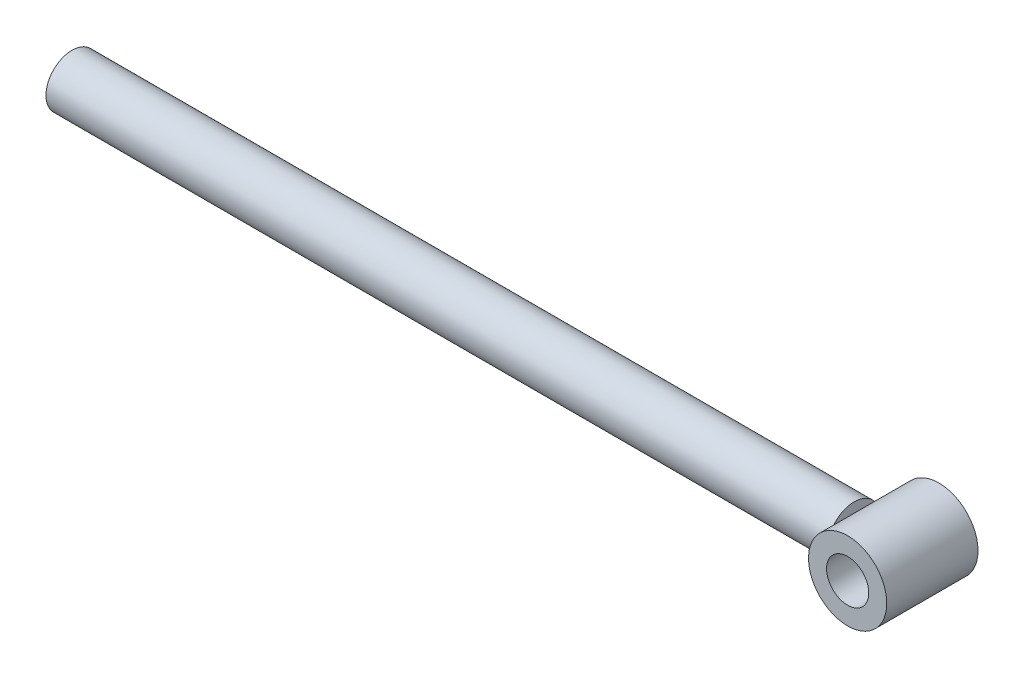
ISO-10303-21;
HEADER;
FILE_DESCRIPTION(('STEP AP214'),'2;1');
FILE_NAME('part.step','',(''),(''),'','','');
FILE_SCHEMA(('AUTOMOTIVE_DESIGN { 1 0 10303 214 1 1 1 1 }'));
ENDSEC;
DATA;
#1=APPLICATION_CONTEXT('core data for automotive mechanical design processes');
#2=APPLICATION_PROTOCOL_DEFINITION('international standard','automotive_design',2000,#1);
#3=PRODUCT_CONTEXT('',#1,'mechanical');
#4=PRODUCT('Part','Part','',(#3));
#5=PRODUCT_RELATED_PRODUCT_CATEGORY('part','',(#4));
#6=PRODUCT_DEFINITION_FORMATION('','',#4);
#7=PRODUCT_DEFINITION_CONTEXT('part definition',#1,'design');
#8=PRODUCT_DEFINITION('design','',#6,#7);
#9=PRODUCT_DEFINITION_SHAPE('','',#8);
#10=(LENGTH_UNIT() NAMED_UNIT(*) SI_UNIT(.MILLI.,.METRE.));
#11=(NAMED_UNIT(*) PLANE_ANGLE_UNIT() SI_UNIT($,.RADIAN.));
#12=(NAMED_UNIT(*) SI_UNIT($,.STERADIAN.) SOLID_ANGLE_UNIT());
#13=UNCERTAINTY_MEASURE_WITH_UNIT(LENGTH_MEASURE(1.E-05),#10,'distance_accuracy_value','');
#14=(GEOMETRIC_REPRESENTATION_CONTEXT(3) GLOBAL_UNCERTAINTY_ASSIGNED_CONTEXT((#13)) GLOBAL_UNIT_ASSIGNED_CONTEXT((#10,
#11,#12)) REPRESENTATION_CONTEXT('',''));
#15=CARTESIAN_POINT('',(0.,0.,0.));
#16=DIRECTION('',(0.,0.,1.));
#17=DIRECTION('',(1.,0.,0.));
#18=AXIS2_PLACEMENT_3D('',#15,#16,#17);
#19=CARTESIAN_POINT('',(315.,0.,17.5));
#20=DIRECTION('',(0.,0.,1.));
#21=DIRECTION('',(1.,0.,0.));
#22=AXIS2_PLACEMENT_3D('',#19,#20,#21);
#23=PLANE('',#22);
#24=CARTESIAN_POINT('',(315.,0.,17.5));
#25=DIRECTION('',(0.,0.,1.));
#26=DIRECTION('',(1.,0.,0.));
#27=AXIS2_PLACEMENT_3D('',#24,#25,#26);
#28=CIRCLE('',#27,15.);
#29=CARTESIAN_POINT('',(330.,0.,17.5));
#30=VERTEX_POINT('',#29);
#31=EDGE_CURVE('E11',#30,#30,#28,.T.);
#32=ORIENTED_EDGE('',*,*,#31,.T.);
#33=EDGE_LOOP('',(#32));
#34=FACE_BOUND('',#33,.T.);
#35=CARTESIAN_POINT('',(315.,0.,17.5));
#36=DIRECTION('',(0.,0.,1.));
#37=DIRECTION('',(1.,0.,0.));
#38=AXIS2_PLACEMENT_3D('',#35,#36,#37);
#39=CIRCLE('',#38,8.09999999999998);
#40=CARTESIAN_POINT('',(323.1,0.,17.5));
#41=VERTEX_POINT('',#40);
#42=EDGE_CURVE('E47',#41,#41,#39,.T.);
#43=ORIENTED_EDGE('',*,*,#42,.F.);
#44=EDGE_LOOP('',(#43));
#45=FACE_BOUND('',#44,.T.);
#46=ADVANCED_FACE('F36',(#34,#45),#23,.T.);
#47=CARTESIAN_POINT('',(315.,0.,-17.5));
#48=DIRECTION('',(0.,0.,1.));
#49=DIRECTION('',(1.,0.,0.));
#50=AXIS2_PLACEMENT_3D('',#47,#48,#49);
#51=PLANE('',#50);
#52=CARTESIAN_POINT('',(315.,0.,-17.5));
#53=DIRECTION('',(0.,0.,1.));
#54=DIRECTION('',(1.,0.,0.));
#55=AXIS2_PLACEMENT_3D('',#52,#53,#54);
#56=CIRCLE('',#55,15.);
#57=CARTESIAN_POINT('',(330.,0.,-17.5));
#58=VERTEX_POINT('',#57);
#59=EDGE_CURVE('E43',#58,#58,#56,.T.);
#60=ORIENTED_EDGE('',*,*,#59,.F.);
#61=EDGE_LOOP('',(#60));
#62=FACE_BOUND('',#61,.T.);
#63=CARTESIAN_POINT('',(315.,0.,-17.5));
#64=DIRECTION('',(0.,0.,1.));
#65=DIRECTION('',(1.,0.,0.));
#66=AXIS2_PLACEMENT_3D('',#63,#64,#65);
#67=CIRCLE('',#66,8.09999999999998);
#68=CARTESIAN_POINT('',(323.1,0.,-17.5));
#69=VERTEX_POINT('',#68);
#70=EDGE_CURVE('E51',#69,#69,#67,.T.);
#71=ORIENTED_EDGE('',*,*,#70,.T.);
#72=EDGE_LOOP('',(#71));
#73=FACE_BOUND('',#72,.T.);
#74=ADVANCED_FACE('F57',(#62,#73),#51,.F.);
#75=CARTESIAN_POINT('',(315.,0.,17.5));
#76=DIRECTION('',(0.,0.,-1.));
#77=DIRECTION('',(-1.,0.,0.));
#78=AXIS2_PLACEMENT_3D('',#75,#76,#77);
#79=CYLINDRICAL_SURFACE('',#78,15.);
#80=ORIENTED_EDGE('',*,*,#31,.F.);
#81=EDGE_LOOP('',(#80));
#82=FACE_BOUND('',#81,.T.);
#83=ORIENTED_EDGE('',*,*,#59,.T.);
#84=EDGE_LOOP('',(#83));
#85=FACE_BOUND('',#84,.T.);
#86=ADVANCED_FACE('F38',(#82,#85),#79,.T.);
#87=CARTESIAN_POINT('',(315.,0.,17.5));
#88=DIRECTION('',(0.,0.,-1.));
#89=DIRECTION('',(-1.,0.,0.));
#90=AXIS2_PLACEMENT_3D('',#87,#88,#89);
#91=CYLINDRICAL_SURFACE('',#90,8.09999999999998);
#92=ORIENTED_EDGE('',*,*,#42,.T.);
#93=EDGE_LOOP('',(#92));
#94=FACE_BOUND('',#93,.T.);
#95=ORIENTED_EDGE('',*,*,#70,.F.);
#96=EDGE_LOOP('',(#95));
#97=FACE_BOUND('',#96,.T.);
#98=ADVANCED_FACE('F59',(#94,#97),#91,.F.);
#99=CLOSED_SHELL('',(#46,#74,#86,#98));
#100=MANIFOLD_SOLID_BREP('B2',#99);
#101=CARTESIAN_POINT('',(300.,0.,0.));
#102=DIRECTION('',(-1.,0.,0.));
#103=DIRECTION('',(0.,0.,1.));
#104=AXIS2_PLACEMENT_3D('',#101,#102,#103);
#105=CYLINDRICAL_SURFACE('',#104,10.);
#106=CARTESIAN_POINT('',(300.,0.,0.));
#107=DIRECTION('',(1.,0.,0.));
#108=DIRECTION('',(0.,0.,-1.));
#109=AXIS2_PLACEMENT_3D('',#106,#107,#108);
#110=CIRCLE('',#109,10.);
#111=CARTESIAN_POINT('',(300.,0.,-10.));
#112=VERTEX_POINT('',#111);
#113=EDGE_CURVE('E35',#112,#112,#110,.T.);
#114=ORIENTED_EDGE('',*,*,#113,.F.);
#115=EDGE_LOOP('',(#114));
#116=FACE_BOUND('',#115,.T.);
#117=CARTESIAN_POINT('',(0.,0.,0.));
#118=DIRECTION('',(1.,0.,0.));
#119=DIRECTION('',(0.,0.,-1.));
#120=AXIS2_PLACEMENT_3D('',#117,#118,#119);
#121=CIRCLE('',#120,10.);
#122=CARTESIAN_POINT('',(0.,0.,-10.));
#123=VERTEX_POINT('',#122);
#124=EDGE_CURVE('E103',#123,#123,#121,.T.);
#125=ORIENTED_EDGE('',*,*,#124,.T.);
#126=EDGE_LOOP('',(#125));
#127=FACE_BOUND('',#126,.T.);
#128=ADVANCED_FACE('F97',(#116,#127),#105,.T.);
#129=CARTESIAN_POINT('',(300.,0.,0.));
#130=DIRECTION('',(1.,0.,0.));
#131=DIRECTION('',(0.,0.,-1.));
#132=AXIS2_PLACEMENT_3D('',#129,#130,#131);
#133=PLANE('',#132);
#134=ORIENTED_EDGE('',*,*,#113,.T.);
#135=EDGE_LOOP('',(#134));
#136=FACE_BOUND('',#135,.T.);
#137=ADVANCED_FACE('F112',(#136),#133,.T.);
#138=CARTESIAN_POINT('',(0.,0.,0.));
#139=DIRECTION('',(1.,0.,0.));
#140=DIRECTION('',(0.,0.,-1.));
#141=AXIS2_PLACEMENT_3D('',#138,#139,#140);
#142=PLANE('',#141);
#143=ORIENTED_EDGE('',*,*,#124,.F.);
#144=EDGE_LOOP('',(#143));
#145=FACE_BOUND('',#144,.T.);
#146=ADVANCED_FACE('F110',(#145),#142,.F.);
#147=CLOSED_SHELL('',(#128,#137,#146));
#148=MANIFOLD_SOLID_BREP('B6',#147);
#149=ADVANCED_BREP_SHAPE_REPRESENTATION('',(#18,#100,#148),#14);
#150=SHAPE_DEFINITION_REPRESENTATION(#9,#149);
ENDSEC;
END-ISO-10303-21;
